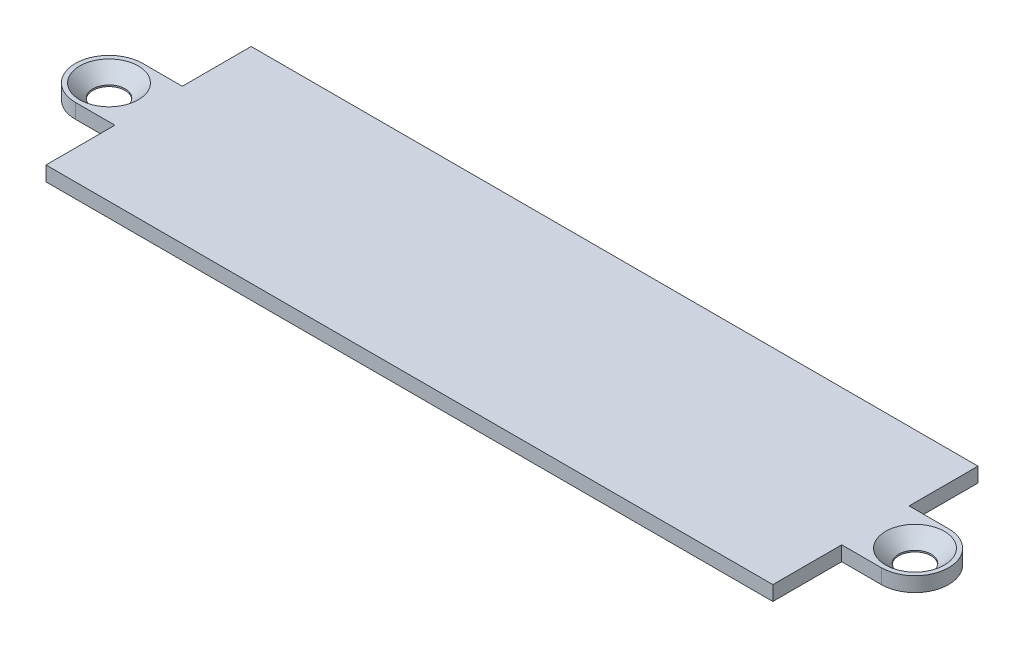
ISO-10303-21;
HEADER;
FILE_DESCRIPTION(('STEP AP214'),'2;1');
FILE_NAME('part.step','',(''),(''),'','','');
FILE_SCHEMA(('AUTOMOTIVE_DESIGN { 1 0 10303 214 1 1 1 1 }'));
ENDSEC;
DATA;
#1=APPLICATION_CONTEXT('core data for automotive mechanical design processes');
#2=APPLICATION_PROTOCOL_DEFINITION('international standard','automotive_design',2000,#1);
#3=PRODUCT_CONTEXT('',#1,'mechanical');
#4=PRODUCT('Part','Part','',(#3));
#5=PRODUCT_RELATED_PRODUCT_CATEGORY('part','',(#4));
#6=PRODUCT_DEFINITION_FORMATION('','',#4);
#7=PRODUCT_DEFINITION_CONTEXT('part definition',#1,'design');
#8=PRODUCT_DEFINITION('design','',#6,#7);
#9=PRODUCT_DEFINITION_SHAPE('','',#8);
#10=(LENGTH_UNIT() NAMED_UNIT(*) SI_UNIT(.MILLI.,.METRE.));
#11=(NAMED_UNIT(*) PLANE_ANGLE_UNIT() SI_UNIT($,.RADIAN.));
#12=(NAMED_UNIT(*) SI_UNIT($,.STERADIAN.) SOLID_ANGLE_UNIT());
#13=UNCERTAINTY_MEASURE_WITH_UNIT(LENGTH_MEASURE(1.E-05),#10,'distance_accuracy_value','');
#14=(GEOMETRIC_REPRESENTATION_CONTEXT(3) GLOBAL_UNCERTAINTY_ASSIGNED_CONTEXT((#13)) GLOBAL_UNIT_ASSIGNED_CONTEXT((#10,
#11,#12)) REPRESENTATION_CONTEXT('',''));
#15=CARTESIAN_POINT('',(0.,0.,0.));
#16=DIRECTION('',(0.,0.,1.));
#17=DIRECTION('',(1.,0.,0.));
#18=AXIS2_PLACEMENT_3D('',#15,#16,#17);
#19=CARTESIAN_POINT('',(0.2,1.,0.));
#20=DIRECTION('',(1.,0.,0.));
#21=DIRECTION('',(0.,0.,-1.));
#22=AXIS2_PLACEMENT_3D('',#19,#20,#21);
#23=PLANE('',#22);
#24=DIRECTION('',(0.,-1.,0.));
#25=VECTOR('',#24,1.);
#26=CARTESIAN_POINT('',(0.200000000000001,1.,4.7));
#27=LINE('',#26,#25);
#28=CARTESIAN_POINT('',(0.200000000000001,1.,4.7));
#29=VERTEX_POINT('',#28);
#30=CARTESIAN_POINT('',(0.200000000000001,0.,4.7));
#31=VERTEX_POINT('',#30);
#32=EDGE_CURVE('E144',#29,#31,#27,.T.);
#33=ORIENTED_EDGE('',*,*,#32,.F.);
#34=DIRECTION('',(0.,0.,-1.));
#35=VECTOR('',#34,1.);
#36=CARTESIAN_POINT('',(0.200000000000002,1.,7.));
#37=LINE('',#36,#35);
#38=CARTESIAN_POINT('',(0.2,1.,0.));
#39=VERTEX_POINT('',#38);
#40=EDGE_CURVE('E12',#29,#39,#37,.T.);
#41=ORIENTED_EDGE('',*,*,#40,.T.);
#42=DIRECTION('',(0.,-1.,0.));
#43=VECTOR('',#42,1.);
#44=CARTESIAN_POINT('',(0.2,1.,0.));
#45=LINE('',#44,#43);
#46=CARTESIAN_POINT('',(0.2,0.,0.));
#47=VERTEX_POINT('',#46);
#48=EDGE_CURVE('E169',#39,#47,#45,.T.);
#49=ORIENTED_EDGE('',*,*,#48,.T.);
#50=DIRECTION('',(0.,0.,1.));
#51=VECTOR('',#50,1.);
#52=CARTESIAN_POINT('',(0.2,0.,0.));
#53=LINE('',#52,#51);
#54=EDGE_CURVE('E161',#47,#31,#53,.T.);
#55=ORIENTED_EDGE('',*,*,#54,.T.);
#56=EDGE_LOOP('',(#33,#41,#49,#55));
#57=FACE_BOUND('',#56,.T.);
#58=ADVANCED_FACE('F50',(#57),#23,.F.);
#59=CARTESIAN_POINT('',(-2.5,1.,4.7));
#60=DIRECTION('',(0.,0.,1.));
#61=DIRECTION('',(1.,0.,0.));
#62=AXIS2_PLACEMENT_3D('',#59,#60,#61);
#63=PLANE('',#62);
#64=DIRECTION('',(0.,-1.,0.));
#65=VECTOR('',#64,1.);
#66=CARTESIAN_POINT('',(-2.5,1.,4.7));
#67=LINE('',#66,#65);
#68=CARTESIAN_POINT('',(-2.5,1.,4.7));
#69=VERTEX_POINT('',#68);
#70=CARTESIAN_POINT('',(-2.5,0.,4.7));
#71=VERTEX_POINT('',#70);
#72=EDGE_CURVE('E155',#69,#71,#67,.T.);
#73=ORIENTED_EDGE('',*,*,#72,.F.);
#74=DIRECTION('',(-1.,0.,0.));
#75=VECTOR('',#74,1.);
#76=CARTESIAN_POINT('',(-2.5,1.,4.7));
#77=LINE('',#76,#75);
#78=EDGE_CURVE('E150',#29,#69,#77,.T.);
#79=ORIENTED_EDGE('',*,*,#78,.F.);
#80=ORIENTED_EDGE('',*,*,#32,.T.);
#81=DIRECTION('',(-1.,0.,0.));
#82=VECTOR('',#81,1.);
#83=CARTESIAN_POINT('',(-2.5,0.,4.7));
#84=LINE('',#83,#82);
#85=EDGE_CURVE('E147',#31,#71,#84,.T.);
#86=ORIENTED_EDGE('',*,*,#85,.T.);
#87=EDGE_LOOP('',(#73,#79,#80,#86));
#88=FACE_BOUND('',#87,.T.);
#89=ADVANCED_FACE('F146',(#88),#63,.F.);
#90=CARTESIAN_POINT('',(-2.5,1.,7.));
#91=DIRECTION('',(0.,-1.,0.));
#92=DIRECTION('',(0.,0.,-1.));
#93=AXIS2_PLACEMENT_3D('',#90,#91,#92);
#94=CYLINDRICAL_SURFACE('',#93,2.3);
#95=DIRECTION('',(0.,1.,0.));
#96=VECTOR('',#95,1.);
#97=CARTESIAN_POINT('',(-2.5,1.,9.3));
#98=LINE('',#97,#96);
#99=CARTESIAN_POINT('',(-2.5,1.,9.3));
#100=VERTEX_POINT('',#99);
#101=CARTESIAN_POINT('',(-2.5,0.,9.3));
#102=VERTEX_POINT('',#101);
#103=EDGE_CURVE('E282',#100,#102,#98,.F.);
#104=ORIENTED_EDGE('',*,*,#103,.F.);
#105=CARTESIAN_POINT('',(-2.5,1.,7.));
#106=DIRECTION('',(0.,1.,0.));
#107=DIRECTION('',(0.,0.,1.));
#108=AXIS2_PLACEMENT_3D('',#105,#106,#107);
#109=CIRCLE('',#108,2.3);
#110=EDGE_CURVE('E187',#69,#100,#109,.T.);
#111=ORIENTED_EDGE('',*,*,#110,.F.);
#112=ORIENTED_EDGE('',*,*,#72,.T.);
#113=CARTESIAN_POINT('',(-2.5,0.,7.));
#114=DIRECTION('',(0.,1.,0.));
#115=DIRECTION('',(0.,0.,1.));
#116=AXIS2_PLACEMENT_3D('',#113,#114,#115);
#117=CIRCLE('',#116,2.3);
#118=EDGE_CURVE('E164',#71,#102,#117,.T.);
#119=ORIENTED_EDGE('',*,*,#118,.T.);
#120=EDGE_LOOP('',(#104,#111,#112,#119));
#121=FACE_BOUND('',#120,.T.);
#122=ADVANCED_FACE('F293',(#121),#94,.T.);
#123=CARTESIAN_POINT('',(-2.5,1.,9.3));
#124=DIRECTION('',(0.,0.,-1.));
#125=DIRECTION('',(-1.,0.,0.));
#126=AXIS2_PLACEMENT_3D('',#123,#124,#125);
#127=PLANE('',#126);
#128=DIRECTION('',(0.,-1.,0.));
#129=VECTOR('',#128,1.);
#130=CARTESIAN_POINT('',(0.200000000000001,1.,9.3));
#131=LINE('',#130,#129);
#132=CARTESIAN_POINT('',(0.200000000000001,1.,9.3));
#133=VERTEX_POINT('',#132);
#134=CARTESIAN_POINT('',(0.200000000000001,0.,9.3));
#135=VERTEX_POINT('',#134);
#136=EDGE_CURVE('E279',#133,#135,#131,.T.);
#137=ORIENTED_EDGE('',*,*,#136,.F.);
#138=DIRECTION('',(1.,0.,0.));
#139=VECTOR('',#138,1.);
#140=CARTESIAN_POINT('',(-2.5,1.,9.3));
#141=LINE('',#140,#139);
#142=EDGE_CURVE('E192',#100,#133,#141,.T.);
#143=ORIENTED_EDGE('',*,*,#142,.F.);
#144=ORIENTED_EDGE('',*,*,#103,.T.);
#145=DIRECTION('',(1.,0.,0.));
#146=VECTOR('',#145,1.);
#147=CARTESIAN_POINT('',(-2.5,0.,9.3));
#148=LINE('',#147,#146);
#149=EDGE_CURVE('E256',#102,#135,#148,.T.);
#150=ORIENTED_EDGE('',*,*,#149,.T.);
#151=EDGE_LOOP('',(#137,#143,#144,#150));
#152=FACE_BOUND('',#151,.T.);
#153=ADVANCED_FACE('F52',(#152),#127,.F.);
#154=CARTESIAN_POINT('',(0.200000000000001,1.,9.5));
#155=DIRECTION('',(1.,0.,0.));
#156=DIRECTION('',(0.,0.,-1.));
#157=AXIS2_PLACEMENT_3D('',#154,#155,#156);
#158=PLANE('',#157);
#159=DIRECTION('',(0.,-1.,0.));
#160=VECTOR('',#159,1.);
#161=CARTESIAN_POINT('',(0.2,1.,14.));
#162=LINE('',#161,#160);
#163=CARTESIAN_POINT('',(0.2,1.,14.));
#164=VERTEX_POINT('',#163);
#165=CARTESIAN_POINT('',(0.2,0.,14.));
#166=VERTEX_POINT('',#165);
#167=EDGE_CURVE('E128',#164,#166,#162,.T.);
#168=ORIENTED_EDGE('',*,*,#167,.F.);
#169=DIRECTION('',(0.,0.,1.));
#170=VECTOR('',#169,1.);
#171=CARTESIAN_POINT('',(0.200000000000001,1.,9.5));
#172=LINE('',#171,#170);
#173=EDGE_CURVE('E196',#133,#164,#172,.T.);
#174=ORIENTED_EDGE('',*,*,#173,.F.);
#175=ORIENTED_EDGE('',*,*,#136,.T.);
#176=DIRECTION('',(0.,0.,1.));
#177=VECTOR('',#176,1.);
#178=CARTESIAN_POINT('',(0.200000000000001,0.,9.5));
#179=LINE('',#178,#177);
#180=EDGE_CURVE('E252',#135,#166,#179,.T.);
#181=ORIENTED_EDGE('',*,*,#180,.T.);
#182=EDGE_LOOP('',(#168,#174,#175,#181));
#183=FACE_BOUND('',#182,.T.);
#184=ADVANCED_FACE('F323',(#183),#158,.F.);
#185=CARTESIAN_POINT('',(0.,1.,14.));
#186=DIRECTION('',(0.,0.,-1.));
#187=DIRECTION('',(-1.,0.,0.));
#188=AXIS2_PLACEMENT_3D('',#185,#186,#187);
#189=PLANE('',#188);
#190=DIRECTION('',(0.,-1.,0.));
#191=VECTOR('',#190,1.);
#192=CARTESIAN_POINT('',(49.8,1.,14.));
#193=LINE('',#192,#191);
#194=CARTESIAN_POINT('',(49.8,1.,14.));
#195=VERTEX_POINT('',#194);
#196=CARTESIAN_POINT('',(49.8,0.,14.));
#197=VERTEX_POINT('',#196);
#198=EDGE_CURVE('E54',#195,#197,#193,.T.);
#199=ORIENTED_EDGE('',*,*,#198,.F.);
#200=DIRECTION('',(1.,0.,0.));
#201=VECTOR('',#200,1.);
#202=CARTESIAN_POINT('',(0.,1.,14.));
#203=LINE('',#202,#201);
#204=EDGE_CURVE('E154',#164,#195,#203,.T.);
#205=ORIENTED_EDGE('',*,*,#204,.F.);
#206=ORIENTED_EDGE('',*,*,#167,.T.);
#207=DIRECTION('',(1.,0.,0.));
#208=VECTOR('',#207,1.);
#209=CARTESIAN_POINT('',(0.,0.,14.));
#210=LINE('',#209,#208);
#211=EDGE_CURVE('E248',#166,#197,#210,.T.);
#212=ORIENTED_EDGE('',*,*,#211,.T.);
#213=EDGE_LOOP('',(#199,#205,#206,#212));
#214=FACE_BOUND('',#213,.T.);
#215=ADVANCED_FACE('F320',(#214),#189,.F.);
#216=CARTESIAN_POINT('',(49.8,1.,9.5));
#217=DIRECTION('',(-1.,0.,0.));
#218=DIRECTION('',(0.,0.,1.));
#219=AXIS2_PLACEMENT_3D('',#216,#217,#218);
#220=PLANE('',#219);
#221=DIRECTION('',(0.,-1.,0.));
#222=VECTOR('',#221,1.);
#223=CARTESIAN_POINT('',(49.8,1.,9.30000000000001));
#224=LINE('',#223,#222);
#225=CARTESIAN_POINT('',(49.8,1.,9.30000000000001));
#226=VERTEX_POINT('',#225);
#227=CARTESIAN_POINT('',(49.8,0.,9.30000000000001));
#228=VERTEX_POINT('',#227);
#229=EDGE_CURVE('E200',#226,#228,#224,.T.);
#230=ORIENTED_EDGE('',*,*,#229,.F.);
#231=DIRECTION('',(0.,0.,-1.));
#232=VECTOR('',#231,1.);
#233=CARTESIAN_POINT('',(49.8,1.,9.5));
#234=LINE('',#233,#232);
#235=EDGE_CURVE('E191',#195,#226,#234,.T.);
#236=ORIENTED_EDGE('',*,*,#235,.F.);
#237=ORIENTED_EDGE('',*,*,#198,.T.);
#238=DIRECTION('',(0.,0.,-1.));
#239=VECTOR('',#238,1.);
#240=CARTESIAN_POINT('',(49.8,0.,9.5));
#241=LINE('',#240,#239);
#242=EDGE_CURVE('E246',#197,#228,#241,.T.);
#243=ORIENTED_EDGE('',*,*,#242,.T.);
#244=EDGE_LOOP('',(#230,#236,#237,#243));
#245=FACE_BOUND('',#244,.T.);
#246=ADVANCED_FACE('F319',(#245),#220,.F.);
#247=CARTESIAN_POINT('',(36.5,1.,9.3));
#248=DIRECTION('',(0.,0.,-1.));
#249=DIRECTION('',(-1.,0.,0.));
#250=AXIS2_PLACEMENT_3D('',#247,#248,#249);
#251=PLANE('',#250);
#252=DIRECTION('',(0.,-1.,0.));
#253=VECTOR('',#252,1.);
#254=CARTESIAN_POINT('',(52.5,1.,9.3));
#255=LINE('',#254,#253);
#256=CARTESIAN_POINT('',(52.5,1.,9.3));
#257=VERTEX_POINT('',#256);
#258=CARTESIAN_POINT('',(52.5,0.,9.3));
#259=VERTEX_POINT('',#258);
#260=EDGE_CURVE('E203',#257,#259,#255,.T.);
#261=ORIENTED_EDGE('',*,*,#260,.F.);
#262=DIRECTION('',(1.,0.,0.));
#263=VECTOR('',#262,1.);
#264=CARTESIAN_POINT('',(36.5,1.,9.3));
#265=LINE('',#264,#263);
#266=EDGE_CURVE('E186',#226,#257,#265,.T.);
#267=ORIENTED_EDGE('',*,*,#266,.F.);
#268=ORIENTED_EDGE('',*,*,#229,.T.);
#269=DIRECTION('',(1.,0.,0.));
#270=VECTOR('',#269,1.);
#271=CARTESIAN_POINT('',(36.5,0.,9.3));
#272=LINE('',#271,#270);
#273=EDGE_CURVE('E243',#228,#259,#272,.T.);
#274=ORIENTED_EDGE('',*,*,#273,.T.);
#275=EDGE_LOOP('',(#261,#267,#268,#274));
#276=FACE_BOUND('',#275,.T.);
#277=ADVANCED_FACE('F317',(#276),#251,.F.);
#278=CARTESIAN_POINT('',(52.5,1.,7.));
#279=DIRECTION('',(0.,-1.,0.));
#280=DIRECTION('',(0.,0.,-1.));
#281=AXIS2_PLACEMENT_3D('',#278,#279,#280);
#282=CYLINDRICAL_SURFACE('',#281,2.3);
#283=DIRECTION('',(0.,1.,0.));
#284=VECTOR('',#283,1.);
#285=CARTESIAN_POINT('',(52.5,1.,4.69999999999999));
#286=LINE('',#285,#284);
#287=CARTESIAN_POINT('',(52.5,1.,4.69999999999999));
#288=VERTEX_POINT('',#287);
#289=CARTESIAN_POINT('',(52.5,0.,4.69999999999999));
#290=VERTEX_POINT('',#289);
#291=EDGE_CURVE('E206',#288,#290,#286,.F.);
#292=ORIENTED_EDGE('',*,*,#291,.F.);
#293=CARTESIAN_POINT('',(52.5,1.,7.));
#294=DIRECTION('',(0.,1.,0.));
#295=DIRECTION('',(0.,0.,1.));
#296=AXIS2_PLACEMENT_3D('',#293,#294,#295);
#297=CIRCLE('',#296,2.3);
#298=EDGE_CURVE('E217',#288,#257,#297,.F.);
#299=ORIENTED_EDGE('',*,*,#298,.T.);
#300=ORIENTED_EDGE('',*,*,#260,.T.);
#301=CARTESIAN_POINT('',(52.5,0.,7.));
#302=DIRECTION('',(0.,1.,0.));
#303=DIRECTION('',(0.,0.,1.));
#304=AXIS2_PLACEMENT_3D('',#301,#302,#303);
#305=CIRCLE('',#304,2.3);
#306=EDGE_CURVE('E239',#259,#290,#305,.T.);
#307=ORIENTED_EDGE('',*,*,#306,.T.);
#308=EDGE_LOOP('',(#292,#299,#300,#307));
#309=FACE_BOUND('',#308,.T.);
#310=ADVANCED_FACE('F314',(#309),#282,.T.);
#311=CARTESIAN_POINT('',(36.5,1.,4.7));
#312=DIRECTION('',(0.,0.,1.));
#313=DIRECTION('',(1.,0.,0.));
#314=AXIS2_PLACEMENT_3D('',#311,#312,#313);
#315=PLANE('',#314);
#316=DIRECTION('',(0.,-1.,0.));
#317=VECTOR('',#316,1.);
#318=CARTESIAN_POINT('',(49.8,1.,4.69999999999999));
#319=LINE('',#318,#317);
#320=CARTESIAN_POINT('',(49.8,1.,4.69999999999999));
#321=VERTEX_POINT('',#320);
#322=CARTESIAN_POINT('',(49.8,0.,4.69999999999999));
#323=VERTEX_POINT('',#322);
#324=EDGE_CURVE('E209',#321,#323,#319,.T.);
#325=ORIENTED_EDGE('',*,*,#324,.F.);
#326=DIRECTION('',(1.,0.,0.));
#327=VECTOR('',#326,1.);
#328=CARTESIAN_POINT('',(-2.5,1.,4.70000000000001));
#329=LINE('',#328,#327);
#330=EDGE_CURVE('E221',#321,#288,#329,.T.);
#331=ORIENTED_EDGE('',*,*,#330,.T.);
#332=ORIENTED_EDGE('',*,*,#291,.T.);
#333=DIRECTION('',(-1.,0.,0.));
#334=VECTOR('',#333,1.);
#335=CARTESIAN_POINT('',(36.5,0.,4.7));
#336=LINE('',#335,#334);
#337=EDGE_CURVE('E235',#290,#323,#336,.T.);
#338=ORIENTED_EDGE('',*,*,#337,.T.);
#339=EDGE_LOOP('',(#325,#331,#332,#338));
#340=FACE_BOUND('',#339,.T.);
#341=ADVANCED_FACE('F311',(#340),#315,.F.);
#342=CARTESIAN_POINT('',(49.8,1.,0.));
#343=DIRECTION('',(-1.,0.,0.));
#344=DIRECTION('',(0.,0.,1.));
#345=AXIS2_PLACEMENT_3D('',#342,#343,#344);
#346=PLANE('',#345);
#347=DIRECTION('',(0.,-1.,0.));
#348=VECTOR('',#347,1.);
#349=CARTESIAN_POINT('',(49.8,1.,0.));
#350=LINE('',#349,#348);
#351=CARTESIAN_POINT('',(49.8,1.,0.));
#352=VERTEX_POINT('',#351);
#353=CARTESIAN_POINT('',(49.8,0.,0.));
#354=VERTEX_POINT('',#353);
#355=EDGE_CURVE('E181',#352,#354,#350,.T.);
#356=ORIENTED_EDGE('',*,*,#355,.F.);
#357=DIRECTION('',(0.,0.,1.));
#358=VECTOR('',#357,1.);
#359=CARTESIAN_POINT('',(49.8,1.,7.));
#360=LINE('',#359,#358);
#361=EDGE_CURVE('E225',#352,#321,#360,.T.);
#362=ORIENTED_EDGE('',*,*,#361,.T.);
#363=ORIENTED_EDGE('',*,*,#324,.T.);
#364=DIRECTION('',(0.,0.,-1.));
#365=VECTOR('',#364,1.);
#366=CARTESIAN_POINT('',(49.8,0.,0.));
#367=LINE('',#366,#365);
#368=EDGE_CURVE('E231',#323,#354,#367,.T.);
#369=ORIENTED_EDGE('',*,*,#368,.T.);
#370=EDGE_LOOP('',(#356,#362,#363,#369));
#371=FACE_BOUND('',#370,.T.);
#372=ADVANCED_FACE('F308',(#371),#346,.F.);
#373=CARTESIAN_POINT('',(0.,1.,0.));
#374=DIRECTION('',(0.,0.,1.));
#375=DIRECTION('',(1.,0.,0.));
#376=AXIS2_PLACEMENT_3D('',#373,#374,#375);
#377=PLANE('',#376);
#378=ORIENTED_EDGE('',*,*,#48,.F.);
#379=DIRECTION('',(1.,0.,0.));
#380=VECTOR('',#379,1.);
#381=CARTESIAN_POINT('',(-2.5,1.,0.));
#382=LINE('',#381,#380);
#383=EDGE_CURVE('E61',#39,#352,#382,.T.);
#384=ORIENTED_EDGE('',*,*,#383,.T.);
#385=ORIENTED_EDGE('',*,*,#355,.T.);
#386=DIRECTION('',(-1.,0.,0.));
#387=VECTOR('',#386,1.);
#388=CARTESIAN_POINT('',(0.,0.,0.));
#389=LINE('',#388,#387);
#390=EDGE_CURVE('E182',#354,#47,#389,.T.);
#391=ORIENTED_EDGE('',*,*,#390,.T.);
#392=EDGE_LOOP('',(#378,#384,#385,#391));
#393=FACE_BOUND('',#392,.T.);
#394=ADVANCED_FACE('F302',(#393),#377,.F.);
#395=CARTESIAN_POINT('',(-2.5,1.,7.));
#396=DIRECTION('',(0.,1.,0.));
#397=DIRECTION('',(0.,0.,1.));
#398=AXIS2_PLACEMENT_3D('',#395,#396,#397);
#399=PLANE('',#398);
#400=ORIENTED_EDGE('',*,*,#266,.T.);
#401=ORIENTED_EDGE('',*,*,#298,.F.);
#402=ORIENTED_EDGE('',*,*,#330,.F.);
#403=ORIENTED_EDGE('',*,*,#361,.F.);
#404=ORIENTED_EDGE('',*,*,#383,.F.);
#405=ORIENTED_EDGE('',*,*,#40,.F.);
#406=ORIENTED_EDGE('',*,*,#78,.T.);
#407=ORIENTED_EDGE('',*,*,#110,.T.);
#408=ORIENTED_EDGE('',*,*,#142,.T.);
#409=ORIENTED_EDGE('',*,*,#173,.T.);
#410=ORIENTED_EDGE('',*,*,#204,.T.);
#411=ORIENTED_EDGE('',*,*,#235,.T.);
#412=EDGE_LOOP('',(#400,#401,#402,#403,#404,#405,#406,#407,#408,#409,#410,#411));
#413=FACE_BOUND('',#412,.T.);
#414=CARTESIAN_POINT('',(-2.5,1.,7.));
#415=DIRECTION('',(0.,-1.,0.));
#416=DIRECTION('',(0.,0.,-1.));
#417=AXIS2_PLACEMENT_3D('',#414,#415,#416);
#418=CIRCLE('',#417,2.);
#419=CARTESIAN_POINT('',(-2.5,1.,5.));
#420=VERTEX_POINT('',#419);
#421=EDGE_CURVE('E172',#420,#420,#418,.T.);
#422=ORIENTED_EDGE('',*,*,#421,.T.);
#423=EDGE_LOOP('',(#422));
#424=FACE_BOUND('',#423,.T.);
#425=CARTESIAN_POINT('',(52.5,1.,7.));
#426=DIRECTION('',(0.,-1.,0.));
#427=DIRECTION('',(0.,0.,-1.));
#428=AXIS2_PLACEMENT_3D('',#425,#426,#427);
#429=CIRCLE('',#428,2.);
#430=CARTESIAN_POINT('',(52.5,1.,5.));
#431=VERTEX_POINT('',#430);
#432=EDGE_CURVE('E176',#431,#431,#429,.T.);
#433=ORIENTED_EDGE('',*,*,#432,.T.);
#434=EDGE_LOOP('',(#433));
#435=FACE_BOUND('',#434,.T.);
#436=ADVANCED_FACE('F299',(#413,#424,#435),#399,.T.);
#437=CARTESIAN_POINT('',(-2.5,0.,7.));
#438=DIRECTION('',(0.,1.,0.));
#439=DIRECTION('',(0.,0.,1.));
#440=AXIS2_PLACEMENT_3D('',#437,#438,#439);
#441=PLANE('',#440);
#442=CARTESIAN_POINT('',(-2.5,0.,7.));
#443=DIRECTION('',(0.,1.,0.));
#444=DIRECTION('',(0.,0.,1.));
#445=AXIS2_PLACEMENT_3D('',#442,#443,#444);
#446=CIRCLE('',#445,1.1);
#447=CARTESIAN_POINT('',(-2.5,0.,8.1));
#448=VERTEX_POINT('',#447);
#449=EDGE_CURVE('E275',#448,#448,#446,.T.);
#450=ORIENTED_EDGE('',*,*,#449,.T.);
#451=EDGE_LOOP('',(#450));
#452=FACE_BOUND('',#451,.T.);
#453=CARTESIAN_POINT('',(52.5,0.,7.));
#454=DIRECTION('',(0.,1.,0.));
#455=DIRECTION('',(0.,0.,1.));
#456=AXIS2_PLACEMENT_3D('',#453,#454,#455);
#457=CIRCLE('',#456,1.1);
#458=CARTESIAN_POINT('',(52.5,0.,8.1));
#459=VERTEX_POINT('',#458);
#460=EDGE_CURVE('E482',#459,#459,#457,.T.);
#461=ORIENTED_EDGE('',*,*,#460,.T.);
#462=EDGE_LOOP('',(#461));
#463=FACE_BOUND('',#462,.T.);
#464=ORIENTED_EDGE('',*,*,#54,.F.);
#465=ORIENTED_EDGE('',*,*,#390,.F.);
#466=ORIENTED_EDGE('',*,*,#368,.F.);
#467=ORIENTED_EDGE('',*,*,#337,.F.);
#468=ORIENTED_EDGE('',*,*,#306,.F.);
#469=ORIENTED_EDGE('',*,*,#273,.F.);
#470=ORIENTED_EDGE('',*,*,#242,.F.);
#471=ORIENTED_EDGE('',*,*,#211,.F.);
#472=ORIENTED_EDGE('',*,*,#180,.F.);
#473=ORIENTED_EDGE('',*,*,#149,.F.);
#474=ORIENTED_EDGE('',*,*,#118,.F.);
#475=ORIENTED_EDGE('',*,*,#85,.F.);
#476=EDGE_LOOP('',(#464,#465,#466,#467,#468,#469,#470,#471,#472,#473,#474,#475));
#477=FACE_BOUND('',#476,.T.);
#478=ADVANCED_FACE('F159',(#452,#463,#477),#441,.F.);
#479=CARTESIAN_POINT('',(52.5,-0.2,7.));
#480=DIRECTION('',(0.,1.,0.));
#481=DIRECTION('',(0.,0.,1.));
#482=AXIS2_PLACEMENT_3D('',#479,#480,#481);
#483=CONICAL_SURFACE('',#482,0.800000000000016,0.785398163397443);
#484=CARTESIAN_POINT('',(52.5,0.0999999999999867,7.));
#485=DIRECTION('',(0.,1.,0.));
#486=DIRECTION('',(0.,0.,1.));
#487=AXIS2_PLACEMENT_3D('',#484,#485,#486);
#488=CIRCLE('',#487,1.1);
#489=CARTESIAN_POINT('',(52.5,0.0999999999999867,8.1));
#490=VERTEX_POINT('',#489);
#491=EDGE_CURVE('E265',#490,#490,#488,.F.);
#492=ORIENTED_EDGE('',*,*,#491,.T.);
#493=EDGE_LOOP('',(#492));
#494=FACE_BOUND('',#493,.T.);
#495=ORIENTED_EDGE('',*,*,#432,.F.);
#496=EDGE_LOOP('',(#495));
#497=FACE_BOUND('',#496,.T.);
#498=ADVANCED_FACE('F397',(#494,#497),#483,.F.);
#499=CARTESIAN_POINT('',(-2.5,-0.2,7.));
#500=DIRECTION('',(0.,1.,0.));
#501=DIRECTION('',(0.,0.,1.));
#502=AXIS2_PLACEMENT_3D('',#499,#500,#501);
#503=CONICAL_SURFACE('',#502,0.800000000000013,0.785398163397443);
#504=CARTESIAN_POINT('',(-2.5,0.0999999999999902,7.));
#505=DIRECTION('',(0.,1.,0.));
#506=DIRECTION('',(0.,0.,1.));
#507=AXIS2_PLACEMENT_3D('',#504,#505,#506);
#508=CIRCLE('',#507,1.1);
#509=CARTESIAN_POINT('',(-2.5,0.0999999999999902,8.1));
#510=VERTEX_POINT('',#509);
#511=EDGE_CURVE('E271',#510,#510,#508,.F.);
#512=ORIENTED_EDGE('',*,*,#511,.T.);
#513=EDGE_LOOP('',(#512));
#514=FACE_BOUND('',#513,.T.);
#515=ORIENTED_EDGE('',*,*,#421,.F.);
#516=EDGE_LOOP('',(#515));
#517=FACE_BOUND('',#516,.T.);
#518=ADVANCED_FACE('F405',(#514,#517),#503,.F.);
#519=CARTESIAN_POINT('',(-2.5,0.,7.));
#520=DIRECTION('',(0.,1.,0.));
#521=DIRECTION('',(0.,0.,1.));
#522=AXIS2_PLACEMENT_3D('',#519,#520,#521);
#523=CYLINDRICAL_SURFACE('',#522,1.1);
#524=ORIENTED_EDGE('',*,*,#449,.F.);
#525=EDGE_LOOP('',(#524));
#526=FACE_BOUND('',#525,.T.);
#527=ORIENTED_EDGE('',*,*,#511,.F.);
#528=EDGE_LOOP('',(#527));
#529=FACE_BOUND('',#528,.T.);
#530=ADVANCED_FACE('F410',(#526,#529),#523,.F.);
#531=CARTESIAN_POINT('',(52.5,0.,7.));
#532=DIRECTION('',(0.,1.,0.));
#533=DIRECTION('',(0.,0.,1.));
#534=AXIS2_PLACEMENT_3D('',#531,#532,#533);
#535=CYLINDRICAL_SURFACE('',#534,1.1);
#536=ORIENTED_EDGE('',*,*,#460,.F.);
#537=EDGE_LOOP('',(#536));
#538=FACE_BOUND('',#537,.T.);
#539=ORIENTED_EDGE('',*,*,#491,.F.);
#540=EDGE_LOOP('',(#539));
#541=FACE_BOUND('',#540,.T.);
#542=ADVANCED_FACE('F426',(#538,#541),#535,.F.);
#543=CLOSED_SHELL('',(#58,#89,#122,#153,#184,#215,#246,#277,#310,#341,#372,#394,#436,#478,#498,
#518,#530,#542));
#544=MANIFOLD_SOLID_BREP('B2',#543);
#545=ADVANCED_BREP_SHAPE_REPRESENTATION('',(#18,#544),#14);
#546=SHAPE_DEFINITION_REPRESENTATION(#9,#545);
ENDSEC;
END-ISO-10303-21;
